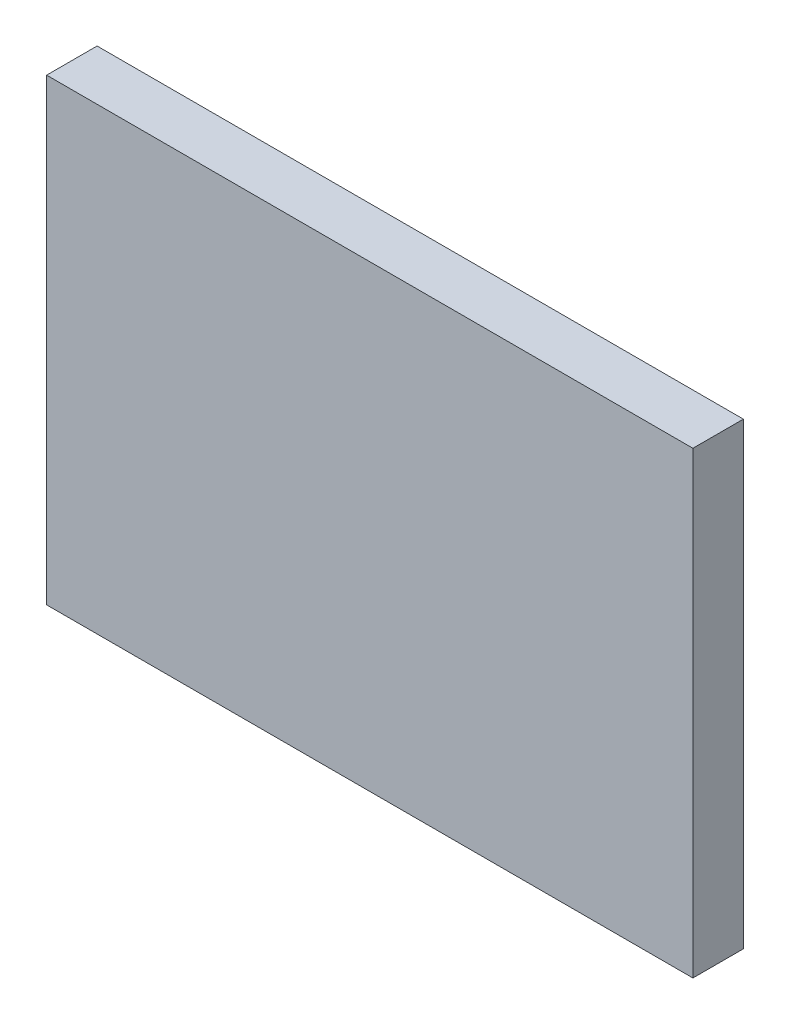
from build123d import *

# Parameters (mm, degrees)
ESQUISSE1_W        = 324
ESQUISSE1_H        = 230
BOSS_EXTRU_1_DEPTH = 12.65


with BuildPart() as part:
    # Esquisse1 → Boss.-Extru.1 (new, symmetric)
    with BuildSketch(Plane.XY):
        Rectangle(ESQUISSE1_W, ESQUISSE1_H)
    extrude(amount=BOSS_EXTRU_1_DEPTH, both=True)


solid = part.part
